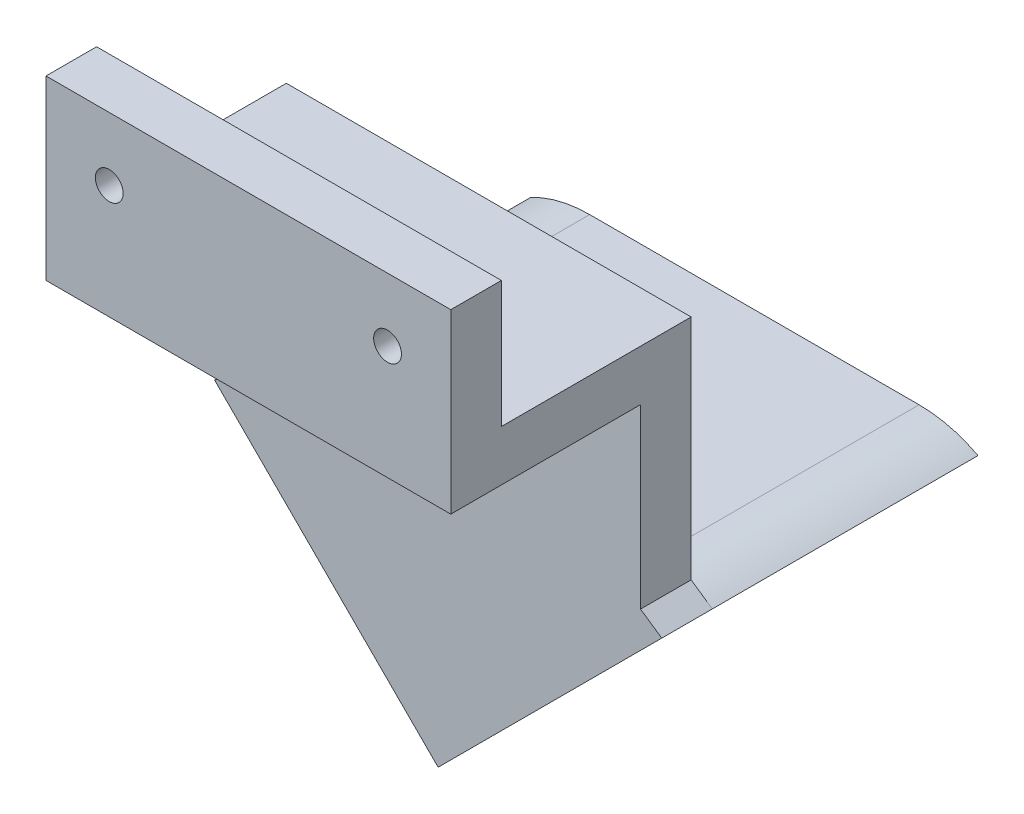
ISO-10303-21;
HEADER;
FILE_DESCRIPTION(('STEP AP214'),'2;1');
FILE_NAME('part.step','',(''),(''),'','','');
FILE_SCHEMA(('AUTOMOTIVE_DESIGN { 1 0 10303 214 1 1 1 1 }'));
ENDSEC;
DATA;
#1=APPLICATION_CONTEXT('core data for automotive mechanical design processes');
#2=APPLICATION_PROTOCOL_DEFINITION('international standard','automotive_design',2000,#1);
#3=PRODUCT_CONTEXT('',#1,'mechanical');
#4=PRODUCT('Part','Part','',(#3));
#5=PRODUCT_RELATED_PRODUCT_CATEGORY('part','',(#4));
#6=PRODUCT_DEFINITION_FORMATION('','',#4);
#7=PRODUCT_DEFINITION_CONTEXT('part definition',#1,'design');
#8=PRODUCT_DEFINITION('design','',#6,#7);
#9=PRODUCT_DEFINITION_SHAPE('','',#8);
#10=(LENGTH_UNIT() NAMED_UNIT(*) SI_UNIT(.MILLI.,.METRE.));
#11=(NAMED_UNIT(*) PLANE_ANGLE_UNIT() SI_UNIT($,.RADIAN.));
#12=(NAMED_UNIT(*) SI_UNIT($,.STERADIAN.) SOLID_ANGLE_UNIT());
#13=UNCERTAINTY_MEASURE_WITH_UNIT(LENGTH_MEASURE(1.E-05),#10,'distance_accuracy_value','');
#14=(GEOMETRIC_REPRESENTATION_CONTEXT(3) GLOBAL_UNCERTAINTY_ASSIGNED_CONTEXT((#13)) GLOBAL_UNIT_ASSIGNED_CONTEXT((#10,
#11,#12)) REPRESENTATION_CONTEXT('',''));
#15=CARTESIAN_POINT('',(0.,0.,0.));
#16=DIRECTION('',(0.,0.,1.));
#17=DIRECTION('',(1.,0.,0.));
#18=AXIS2_PLACEMENT_3D('',#15,#16,#17);
#19=CARTESIAN_POINT('',(0.,0.,-15.));
#20=DIRECTION('',(0.,0.,-1.));
#21=DIRECTION('',(-1.,0.,0.));
#22=AXIS2_PLACEMENT_3D('',#19,#20,#21);
#23=PLANE('',#22);
#24=DIRECTION('',(0.,-1.,0.));
#25=VECTOR('',#24,1.);
#26=CARTESIAN_POINT('',(11.5240963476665,-0.296650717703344,-15.));
#27=LINE('',#26,#25);
#28=CARTESIAN_POINT('',(11.5240963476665,3.70334928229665,-15.));
#29=VERTEX_POINT('',#28);
#30=CARTESIAN_POINT('',(11.5240963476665,-14.2966507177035,-15.));
#31=VERTEX_POINT('',#30);
#32=EDGE_CURVE('E155',#29,#31,#27,.T.);
#33=ORIENTED_EDGE('',*,*,#32,.T.);
#34=DIRECTION('',(-0.824647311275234,0.565647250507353,0.));
#35=VECTOR('',#34,1.);
#36=CARTESIAN_POINT('',(13.2017658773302,-15.4474083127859,-15.));
#37=LINE('',#36,#35);
#38=CARTESIAN_POINT('',(13.2017658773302,-15.4474083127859,-15.));
#39=VERTEX_POINT('',#38);
#40=EDGE_CURVE('E137',#39,#31,#37,.T.);
#41=ORIENTED_EDGE('',*,*,#40,.F.);
#42=CARTESIAN_POINT('',(8.54441589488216,-24.2966507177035,-15.));
#43=DIRECTION('',(0.,0.,-1.));
#44=DIRECTION('',(-1.,0.,0.));
#45=AXIS2_PLACEMENT_3D('',#42,#43,#44);
#46=CIRCLE('',#45,10.);
#47=CARTESIAN_POINT('',(8.54441589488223,-14.2966507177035,-15.));
#48=VERTEX_POINT('',#47);
#49=EDGE_CURVE('E48',#39,#48,#46,.F.);
#50=ORIENTED_EDGE('',*,*,#49,.T.);
#51=DIRECTION('',(1.,0.,0.));
#52=VECTOR('',#51,1.);
#53=CARTESIAN_POINT('',(-20.4759036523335,-14.2966507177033,-15.));
#54=LINE('',#53,#52);
#55=CARTESIAN_POINT('',(-17.4962231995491,-14.2966507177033,-15.));
#56=VERTEX_POINT('',#55);
#57=EDGE_CURVE('E253',#56,#48,#54,.T.);
#58=ORIENTED_EDGE('',*,*,#57,.F.);
#59=CARTESIAN_POINT('',(-17.4962231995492,-24.2966507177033,-15.));
#60=DIRECTION('',(0.,0.,-1.));
#61=DIRECTION('',(-1.,0.,0.));
#62=AXIS2_PLACEMENT_3D('',#59,#60,#61);
#63=CIRCLE('',#62,10.);
#64=CARTESIAN_POINT('',(-22.1535731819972,-15.4474083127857,-15.));
#65=VERTEX_POINT('',#64);
#66=EDGE_CURVE('E11',#56,#65,#63,.F.);
#67=ORIENTED_EDGE('',*,*,#66,.T.);
#68=DIRECTION('',(-0.824647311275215,-0.56564725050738,0.));
#69=VECTOR('',#68,1.);
#70=CARTESIAN_POINT('',(-22.1535731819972,-15.4474083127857,-15.));
#71=LINE('',#70,#69);
#72=CARTESIAN_POINT('',(-20.4759036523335,-14.2966507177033,-15.));
#73=VERTEX_POINT('',#72);
#74=EDGE_CURVE('E54',#73,#65,#71,.T.);
#75=ORIENTED_EDGE('',*,*,#74,.F.);
#76=DIRECTION('',(0.,1.,0.));
#77=VECTOR('',#76,1.);
#78=CARTESIAN_POINT('',(-20.4759036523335,-0.296650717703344,-15.));
#79=LINE('',#78,#77);
#80=CARTESIAN_POINT('',(-20.4759036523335,3.70334928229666,-15.));
#81=VERTEX_POINT('',#80);
#82=EDGE_CURVE('E172',#73,#81,#79,.T.);
#83=ORIENTED_EDGE('',*,*,#82,.T.);
#84=DIRECTION('',(1.,0.,0.));
#85=VECTOR('',#84,1.);
#86=CARTESIAN_POINT('',(-20.4759036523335,3.70334928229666,-15.));
#87=LINE('',#86,#85);
#88=EDGE_CURVE('E163',#81,#29,#87,.T.);
#89=ORIENTED_EDGE('',*,*,#88,.T.);
#90=EDGE_LOOP('',(#33,#41,#50,#58,#67,#75,#83,#89));
#91=FACE_BOUND('',#90,.T.);
#92=ADVANCED_FACE('F39',(#91),#23,.T.);
#93=CARTESIAN_POINT('',(-20.4759036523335,13.7033492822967,4.00000000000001));
#94=DIRECTION('',(1.,0.,0.));
#95=DIRECTION('',(0.,1.,0.));
#96=AXIS2_PLACEMENT_3D('',#93,#94,#95);
#97=PLANE('',#96);
#98=DIRECTION('',(0.,0.,1.));
#99=VECTOR('',#98,1.);
#100=CARTESIAN_POINT('',(-20.4759036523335,-14.2966507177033,-92.0351476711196));
#101=LINE('',#100,#99);
#102=CARTESIAN_POINT('',(-20.4759036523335,-14.2966507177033,-11.));
#103=VERTEX_POINT('',#102);
#104=EDGE_CURVE('E160',#73,#103,#101,.T.);
#105=ORIENTED_EDGE('',*,*,#104,.T.);
#106=DIRECTION('',(0.,1.,0.));
#107=VECTOR('',#106,1.);
#108=CARTESIAN_POINT('',(-20.4759036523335,-30.2966507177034,-11.));
#109=LINE('',#108,#107);
#110=CARTESIAN_POINT('',(-20.4759036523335,-0.296650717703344,-11.));
#111=VERTEX_POINT('',#110);
#112=EDGE_CURVE('E314',#103,#111,#109,.T.);
#113=ORIENTED_EDGE('',*,*,#112,.T.);
#114=DIRECTION('',(0.,0.,-1.));
#115=VECTOR('',#114,1.);
#116=CARTESIAN_POINT('',(-20.4759036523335,-0.296650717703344,4.00000000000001));
#117=LINE('',#116,#115);
#118=CARTESIAN_POINT('',(-20.4759036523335,-0.296650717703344,4.00000000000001));
#119=VERTEX_POINT('',#118);
#120=EDGE_CURVE('E231',#119,#111,#117,.T.);
#121=ORIENTED_EDGE('',*,*,#120,.F.);
#122=DIRECTION('',(0.,-1.,0.));
#123=VECTOR('',#122,1.);
#124=CARTESIAN_POINT('',(-20.4759036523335,13.7033492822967,4.00000000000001));
#125=LINE('',#124,#123);
#126=CARTESIAN_POINT('',(-20.4759036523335,13.7033492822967,4.00000000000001));
#127=VERTEX_POINT('',#126);
#128=EDGE_CURVE('E196',#127,#119,#125,.T.);
#129=ORIENTED_EDGE('',*,*,#128,.F.);
#130=DIRECTION('',(0.,0.,-1.));
#131=VECTOR('',#130,1.);
#132=CARTESIAN_POINT('',(-20.4759036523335,13.7033492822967,4.00000000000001));
#133=LINE('',#132,#131);
#134=CARTESIAN_POINT('',(-20.4759036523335,13.7033492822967,0.));
#135=VERTEX_POINT('',#134);
#136=EDGE_CURVE('E212',#127,#135,#133,.T.);
#137=ORIENTED_EDGE('',*,*,#136,.T.);
#138=DIRECTION('',(0.,-1.,0.));
#139=VECTOR('',#138,1.);
#140=CARTESIAN_POINT('',(-20.4759036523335,13.7033492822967,0.));
#141=LINE('',#140,#139);
#142=CARTESIAN_POINT('',(-20.4759036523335,3.70334928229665,0.));
#143=VERTEX_POINT('',#142);
#144=EDGE_CURVE('E213',#135,#143,#141,.T.);
#145=ORIENTED_EDGE('',*,*,#144,.T.);
#146=DIRECTION('',(0.,0.,1.));
#147=VECTOR('',#146,1.);
#148=CARTESIAN_POINT('',(-20.4759036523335,3.70334928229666,-15.));
#149=LINE('',#148,#147);
#150=EDGE_CURVE('E170',#81,#143,#149,.T.);
#151=ORIENTED_EDGE('',*,*,#150,.F.);
#152=ORIENTED_EDGE('',*,*,#82,.F.);
#153=EDGE_LOOP('',(#105,#113,#121,#129,#137,#145,#151,#152));
#154=FACE_BOUND('',#153,.T.);
#155=ADVANCED_FACE('F324',(#154),#97,.F.);
#156=CARTESIAN_POINT('',(11.5240963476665,13.7033492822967,4.00000000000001));
#157=DIRECTION('',(1.,0.,0.));
#158=DIRECTION('',(0.,0.,-1.));
#159=AXIS2_PLACEMENT_3D('',#156,#157,#158);
#160=PLANE('',#159);
#161=DIRECTION('',(0.,1.,0.));
#162=VECTOR('',#161,1.);
#163=CARTESIAN_POINT('',(11.5240963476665,-30.2966507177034,-11.));
#164=LINE('',#163,#162);
#165=CARTESIAN_POINT('',(11.5240963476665,-14.2966507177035,-11.));
#166=VERTEX_POINT('',#165);
#167=CARTESIAN_POINT('',(11.5240963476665,-0.296650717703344,-11.));
#168=VERTEX_POINT('',#167);
#169=EDGE_CURVE('E157',#166,#168,#164,.T.);
#170=ORIENTED_EDGE('',*,*,#169,.F.);
#171=DIRECTION('',(0.,0.,1.));
#172=VECTOR('',#171,1.);
#173=CARTESIAN_POINT('',(11.5240963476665,-14.2966507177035,-92.0351476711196));
#174=LINE('',#173,#172);
#175=EDGE_CURVE('E141',#31,#166,#174,.T.);
#176=ORIENTED_EDGE('',*,*,#175,.F.);
#177=ORIENTED_EDGE('',*,*,#32,.F.);
#178=DIRECTION('',(0.,0.,1.));
#179=VECTOR('',#178,1.);
#180=CARTESIAN_POINT('',(11.5240963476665,3.70334928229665,-15.));
#181=LINE('',#180,#179);
#182=CARTESIAN_POINT('',(11.5240963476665,3.70334928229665,0.));
#183=VERTEX_POINT('',#182);
#184=EDGE_CURVE('E166',#29,#183,#181,.T.);
#185=ORIENTED_EDGE('',*,*,#184,.T.);
#186=DIRECTION('',(0.,-1.,0.));
#187=VECTOR('',#186,1.);
#188=CARTESIAN_POINT('',(11.5240963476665,13.7033492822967,0.));
#189=LINE('',#188,#187);
#190=CARTESIAN_POINT('',(11.5240963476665,13.7033492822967,0.));
#191=VERTEX_POINT('',#190);
#192=EDGE_CURVE('E217',#191,#183,#189,.T.);
#193=ORIENTED_EDGE('',*,*,#192,.F.);
#194=DIRECTION('',(0.,0.,-1.));
#195=VECTOR('',#194,1.);
#196=CARTESIAN_POINT('',(11.5240963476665,13.7033492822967,4.00000000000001));
#197=LINE('',#196,#195);
#198=CARTESIAN_POINT('',(11.5240963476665,13.7033492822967,4.00000000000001));
#199=VERTEX_POINT('',#198);
#200=EDGE_CURVE('E225',#199,#191,#197,.T.);
#201=ORIENTED_EDGE('',*,*,#200,.F.);
#202=DIRECTION('',(0.,-1.,0.));
#203=VECTOR('',#202,1.);
#204=CARTESIAN_POINT('',(11.5240963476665,13.7033492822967,4.00000000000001));
#205=LINE('',#204,#203);
#206=CARTESIAN_POINT('',(11.5240963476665,-0.296650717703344,4.00000000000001));
#207=VERTEX_POINT('',#206);
#208=EDGE_CURVE('E204',#199,#207,#205,.T.);
#209=ORIENTED_EDGE('',*,*,#208,.T.);
#210=DIRECTION('',(0.,0.,-1.));
#211=VECTOR('',#210,1.);
#212=CARTESIAN_POINT('',(11.5240963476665,-0.296650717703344,4.00000000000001));
#213=LINE('',#212,#211);
#214=EDGE_CURVE('E228',#207,#168,#213,.T.);
#215=ORIENTED_EDGE('',*,*,#214,.T.);
#216=EDGE_LOOP('',(#170,#176,#177,#185,#193,#201,#209,#215));
#217=FACE_BOUND('',#216,.T.);
#218=ADVANCED_FACE('F153',(#217),#160,.T.);
#219=CARTESIAN_POINT('',(-20.4759036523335,-0.296650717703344,4.00000000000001));
#220=DIRECTION('',(0.,1.,0.));
#221=DIRECTION('',(0.,0.,1.));
#222=AXIS2_PLACEMENT_3D('',#219,#220,#221);
#223=PLANE('',#222);
#224=DIRECTION('',(-1.,0.,0.));
#225=VECTOR('',#224,1.);
#226=CARTESIAN_POINT('',(11.5240963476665,-0.296650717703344,-11.));
#227=LINE('',#226,#225);
#228=EDGE_CURVE('E159',#168,#111,#227,.T.);
#229=ORIENTED_EDGE('',*,*,#228,.F.);
#230=ORIENTED_EDGE('',*,*,#214,.F.);
#231=DIRECTION('',(1.,0.,0.));
#232=VECTOR('',#231,1.);
#233=CARTESIAN_POINT('',(-20.4759036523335,-0.296650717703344,4.00000000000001));
#234=LINE('',#233,#232);
#235=EDGE_CURVE('E200',#119,#207,#234,.T.);
#236=ORIENTED_EDGE('',*,*,#235,.F.);
#237=ORIENTED_EDGE('',*,*,#120,.T.);
#238=EDGE_LOOP('',(#229,#230,#236,#237));
#239=FACE_BOUND('',#238,.T.);
#240=ADVANCED_FACE('F341',(#239),#223,.F.);
#241=CARTESIAN_POINT('',(0.,0.,0.));
#242=DIRECTION('',(0.,0.,1.));
#243=DIRECTION('',(1.,0.,0.));
#244=AXIS2_PLACEMENT_3D('',#241,#242,#243);
#245=PLANE('',#244);
#246=CARTESIAN_POINT('',(6.52409634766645,8.70334928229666,0.));
#247=DIRECTION('',(0.,0.,1.));
#248=DIRECTION('',(1.,0.,0.));
#249=AXIS2_PLACEMENT_3D('',#246,#247,#248);
#250=CIRCLE('',#249,1.1);
#251=CARTESIAN_POINT('',(7.62409634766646,8.70334928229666,0.));
#252=VERTEX_POINT('',#251);
#253=EDGE_CURVE('E195',#252,#252,#250,.F.);
#254=ORIENTED_EDGE('',*,*,#253,.F.);
#255=EDGE_LOOP('',(#254));
#256=FACE_BOUND('',#255,.T.);
#257=CARTESIAN_POINT('',(-15.4759036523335,8.70334928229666,0.));
#258=DIRECTION('',(0.,0.,1.));
#259=DIRECTION('',(1.,0.,0.));
#260=AXIS2_PLACEMENT_3D('',#257,#258,#259);
#261=CIRCLE('',#260,1.1);
#262=CARTESIAN_POINT('',(-14.3759036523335,8.70334928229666,0.));
#263=VERTEX_POINT('',#262);
#264=EDGE_CURVE('E183',#263,#263,#261,.T.);
#265=ORIENTED_EDGE('',*,*,#264,.T.);
#266=EDGE_LOOP('',(#265));
#267=FACE_BOUND('',#266,.T.);
#268=DIRECTION('',(1.,0.,0.));
#269=VECTOR('',#268,1.);
#270=CARTESIAN_POINT('',(-20.4759036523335,3.70334928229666,0.));
#271=LINE('',#270,#269);
#272=EDGE_CURVE('E176',#143,#183,#271,.T.);
#273=ORIENTED_EDGE('',*,*,#272,.F.);
#274=ORIENTED_EDGE('',*,*,#144,.F.);
#275=DIRECTION('',(1.,0.,0.));
#276=VECTOR('',#275,1.);
#277=CARTESIAN_POINT('',(-20.4759036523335,13.7033492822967,0.));
#278=LINE('',#277,#276);
#279=EDGE_CURVE('E201',#135,#191,#278,.T.);
#280=ORIENTED_EDGE('',*,*,#279,.T.);
#281=ORIENTED_EDGE('',*,*,#192,.T.);
#282=EDGE_LOOP('',(#273,#274,#280,#281));
#283=FACE_BOUND('',#282,.T.);
#284=ADVANCED_FACE('F329',(#256,#267,#283),#245,.F.);
#285=CARTESIAN_POINT('',(-20.4759036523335,13.7033492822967,4.00000000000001));
#286=DIRECTION('',(0.,1.,0.));
#287=DIRECTION('',(0.,0.,1.));
#288=AXIS2_PLACEMENT_3D('',#285,#286,#287);
#289=PLANE('',#288);
#290=ORIENTED_EDGE('',*,*,#279,.F.);
#291=ORIENTED_EDGE('',*,*,#136,.F.);
#292=DIRECTION('',(1.,0.,0.));
#293=VECTOR('',#292,1.);
#294=CARTESIAN_POINT('',(-20.4759036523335,13.7033492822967,4.00000000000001));
#295=LINE('',#294,#293);
#296=EDGE_CURVE('E208',#127,#199,#295,.T.);
#297=ORIENTED_EDGE('',*,*,#296,.T.);
#298=ORIENTED_EDGE('',*,*,#200,.T.);
#299=EDGE_LOOP('',(#290,#291,#297,#298));
#300=FACE_BOUND('',#299,.T.);
#301=ADVANCED_FACE('F331',(#300),#289,.T.);
#302=CARTESIAN_POINT('',(0.,0.,4.00000000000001));
#303=DIRECTION('',(0.,0.,1.));
#304=DIRECTION('',(1.,0.,0.));
#305=AXIS2_PLACEMENT_3D('',#302,#303,#304);
#306=PLANE('',#305);
#307=CARTESIAN_POINT('',(-15.4759036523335,8.70334928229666,4.00000000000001));
#308=DIRECTION('',(0.,0.,1.));
#309=DIRECTION('',(1.,0.,0.));
#310=AXIS2_PLACEMENT_3D('',#307,#308,#309);
#311=CIRCLE('',#310,1.1);
#312=CARTESIAN_POINT('',(-14.3759036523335,8.70334928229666,4.00000000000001));
#313=VERTEX_POINT('',#312);
#314=EDGE_CURVE('E187',#313,#313,#311,.F.);
#315=ORIENTED_EDGE('',*,*,#314,.T.);
#316=EDGE_LOOP('',(#315));
#317=FACE_BOUND('',#316,.T.);
#318=CARTESIAN_POINT('',(6.52409634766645,8.70334928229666,4.00000000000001));
#319=DIRECTION('',(0.,0.,1.));
#320=DIRECTION('',(1.,0.,0.));
#321=AXIS2_PLACEMENT_3D('',#318,#319,#320);
#322=CIRCLE('',#321,1.1);
#323=CARTESIAN_POINT('',(7.62409634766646,8.70334928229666,4.00000000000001));
#324=VERTEX_POINT('',#323);
#325=EDGE_CURVE('E191',#324,#324,#322,.T.);
#326=ORIENTED_EDGE('',*,*,#325,.F.);
#327=EDGE_LOOP('',(#326));
#328=FACE_BOUND('',#327,.T.);
#329=ORIENTED_EDGE('',*,*,#128,.T.);
#330=ORIENTED_EDGE('',*,*,#235,.T.);
#331=ORIENTED_EDGE('',*,*,#208,.F.);
#332=ORIENTED_EDGE('',*,*,#296,.F.);
#333=EDGE_LOOP('',(#329,#330,#331,#332));
#334=FACE_BOUND('',#333,.T.);
#335=ADVANCED_FACE('F336',(#317,#328,#334),#306,.T.);
#336=CARTESIAN_POINT('',(6.52409634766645,8.70334928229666,4.00000000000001));
#337=DIRECTION('',(0.,0.,-1.));
#338=DIRECTION('',(-1.,0.,0.));
#339=AXIS2_PLACEMENT_3D('',#336,#337,#338);
#340=CYLINDRICAL_SURFACE('',#339,1.1);
#341=ORIENTED_EDGE('',*,*,#325,.T.);
#342=EDGE_LOOP('',(#341));
#343=FACE_BOUND('',#342,.T.);
#344=ORIENTED_EDGE('',*,*,#253,.T.);
#345=EDGE_LOOP('',(#344));
#346=FACE_BOUND('',#345,.T.);
#347=ADVANCED_FACE('F375',(#343,#346),#340,.F.);
#348=CARTESIAN_POINT('',(-15.4759036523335,8.70334928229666,5.00000000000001));
#349=DIRECTION('',(0.,0.,-1.));
#350=DIRECTION('',(-1.,0.,0.));
#351=AXIS2_PLACEMENT_3D('',#348,#349,#350);
#352=CYLINDRICAL_SURFACE('',#351,1.1);
#353=ORIENTED_EDGE('',*,*,#314,.F.);
#354=EDGE_LOOP('',(#353));
#355=FACE_BOUND('',#354,.T.);
#356=ORIENTED_EDGE('',*,*,#264,.F.);
#357=EDGE_LOOP('',(#356));
#358=FACE_BOUND('',#357,.T.);
#359=ADVANCED_FACE('F372',(#355,#358),#352,.F.);
#360=CARTESIAN_POINT('',(-20.4759036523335,3.70334928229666,-15.));
#361=DIRECTION('',(0.,-1.,0.));
#362=DIRECTION('',(1.,0.,0.));
#363=AXIS2_PLACEMENT_3D('',#360,#361,#362);
#364=PLANE('',#363);
#365=ORIENTED_EDGE('',*,*,#272,.T.);
#366=ORIENTED_EDGE('',*,*,#184,.F.);
#367=ORIENTED_EDGE('',*,*,#88,.F.);
#368=ORIENTED_EDGE('',*,*,#150,.T.);
#369=EDGE_LOOP('',(#365,#366,#367,#368));
#370=FACE_BOUND('',#369,.T.);
#371=ADVANCED_FACE('F323',(#370),#364,.F.);
#372=CARTESIAN_POINT('',(11.5240963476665,-30.2966507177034,-11.));
#373=DIRECTION('',(0.,0.,-1.));
#374=DIRECTION('',(-1.,0.,0.));
#375=AXIS2_PLACEMENT_3D('',#372,#373,#374);
#376=PLANE('',#375);
#377=DIRECTION('',(0.824647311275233,-0.565647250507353,0.));
#378=VECTOR('',#377,1.);
#379=CARTESIAN_POINT('',(13.2017658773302,-15.4474083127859,-11.));
#380=LINE('',#379,#378);
#381=CARTESIAN_POINT('',(13.2017658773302,-15.4474083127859,-11.));
#382=VERTEX_POINT('',#381);
#383=EDGE_CURVE('E283',#166,#382,#380,.T.);
#384=ORIENTED_EDGE('',*,*,#383,.F.);
#385=ORIENTED_EDGE('',*,*,#169,.T.);
#386=ORIENTED_EDGE('',*,*,#228,.T.);
#387=ORIENTED_EDGE('',*,*,#112,.F.);
#388=DIRECTION('',(0.824647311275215,0.56564725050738,0.));
#389=VECTOR('',#388,1.);
#390=CARTESIAN_POINT('',(-22.1535731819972,-15.4474083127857,-11.));
#391=LINE('',#390,#389);
#392=CARTESIAN_POINT('',(-22.1535731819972,-15.4474083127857,-11.));
#393=VERTEX_POINT('',#392);
#394=EDGE_CURVE('E296',#393,#103,#391,.T.);
#395=ORIENTED_EDGE('',*,*,#394,.F.);
#396=DIRECTION('',(-0.707106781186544,0.707106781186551,0.));
#397=VECTOR('',#396,1.);
#398=CARTESIAN_POINT('',(-4.4759036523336,-33.1250778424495,-11.));
#399=LINE('',#398,#397);
#400=CARTESIAN_POINT('',(-4.4759036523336,-33.1250778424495,-11.));
#401=VERTEX_POINT('',#400);
#402=EDGE_CURVE('E292',#401,#393,#399,.T.);
#403=ORIENTED_EDGE('',*,*,#402,.F.);
#404=DIRECTION('',(-0.707106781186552,-0.707106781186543,0.));
#405=VECTOR('',#404,1.);
#406=CARTESIAN_POINT('',(-4.4759036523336,-33.1250778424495,-11.));
#407=LINE('',#406,#405);
#408=EDGE_CURVE('E289',#382,#401,#407,.T.);
#409=ORIENTED_EDGE('',*,*,#408,.F.);
#410=EDGE_LOOP('',(#384,#385,#386,#387,#395,#403,#409));
#411=FACE_BOUND('',#410,.T.);
#412=ADVANCED_FACE('F344',(#411),#376,.F.);
#413=CARTESIAN_POINT('',(-22.1535731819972,-15.4474083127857,-11.));
#414=DIRECTION('',(-0.56564725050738,0.824647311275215,0.));
#415=DIRECTION('',(-0.824647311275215,-0.56564725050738,0.));
#416=AXIS2_PLACEMENT_3D('',#413,#414,#415);
#417=PLANE('',#416);
#418=ORIENTED_EDGE('',*,*,#104,.F.);
#419=ORIENTED_EDGE('',*,*,#74,.T.);
#420=DIRECTION('',(0.,0.,-1.));
#421=VECTOR('',#420,1.);
#422=CARTESIAN_POINT('',(-22.1535731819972,-15.4474083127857,-11.));
#423=LINE('',#422,#421);
#424=EDGE_CURVE('E299',#393,#65,#423,.T.);
#425=ORIENTED_EDGE('',*,*,#424,.F.);
#426=ORIENTED_EDGE('',*,*,#394,.T.);
#427=EDGE_LOOP('',(#418,#419,#425,#426));
#428=FACE_BOUND('',#427,.T.);
#429=ADVANCED_FACE('F426',(#428),#417,.T.);
#430=CARTESIAN_POINT('',(-4.4759036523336,-33.1250778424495,-11.));
#431=DIRECTION('',(-0.707106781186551,-0.707106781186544,0.));
#432=DIRECTION('',(0.707106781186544,-0.707106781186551,0.));
#433=AXIS2_PLACEMENT_3D('',#430,#431,#432);
#434=PLANE('',#433);
#435=ORIENTED_EDGE('',*,*,#424,.T.);
#436=CARTESIAN_POINT('',(-22.1535731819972,-15.4474083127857,-36.));
#437=VERTEX_POINT('',#436);
#438=EDGE_CURVE('E303',#65,#437,#423,.T.);
#439=ORIENTED_EDGE('',*,*,#438,.T.);
#440=DIRECTION('',(-0.707106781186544,0.707106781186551,0.));
#441=VECTOR('',#440,1.);
#442=CARTESIAN_POINT('',(-4.4759036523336,-33.1250778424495,-36.));
#443=LINE('',#442,#441);
#444=CARTESIAN_POINT('',(-4.4759036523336,-33.1250778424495,-36.));
#445=VERTEX_POINT('',#444);
#446=EDGE_CURVE('E279',#445,#437,#443,.T.);
#447=ORIENTED_EDGE('',*,*,#446,.F.);
#448=DIRECTION('',(0.,0.,-1.));
#449=VECTOR('',#448,1.);
#450=CARTESIAN_POINT('',(-4.4759036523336,-33.1250778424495,-11.));
#451=LINE('',#450,#449);
#452=EDGE_CURVE('E277',#401,#445,#451,.T.);
#453=ORIENTED_EDGE('',*,*,#452,.F.);
#454=ORIENTED_EDGE('',*,*,#402,.T.);
#455=EDGE_LOOP('',(#435,#439,#447,#453,#454));
#456=FACE_BOUND('',#455,.T.);
#457=ADVANCED_FACE('F349',(#456),#434,.T.);
#458=CARTESIAN_POINT('',(-4.4759036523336,-33.1250778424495,-11.));
#459=DIRECTION('',(0.707106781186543,-0.707106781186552,0.));
#460=DIRECTION('',(0.707106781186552,0.707106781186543,0.));
#461=AXIS2_PLACEMENT_3D('',#458,#459,#460);
#462=PLANE('',#461);
#463=ORIENTED_EDGE('',*,*,#452,.T.);
#464=DIRECTION('',(-0.707106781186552,-0.707106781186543,0.));
#465=VECTOR('',#464,1.);
#466=CARTESIAN_POINT('',(-4.4759036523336,-33.1250778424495,-36.));
#467=LINE('',#466,#465);
#468=CARTESIAN_POINT('',(13.2017658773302,-15.4474083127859,-36.));
#469=VERTEX_POINT('',#468);
#470=EDGE_CURVE('E272',#469,#445,#467,.T.);
#471=ORIENTED_EDGE('',*,*,#470,.F.);
#472=DIRECTION('',(0.,0.,-1.));
#473=VECTOR('',#472,1.);
#474=CARTESIAN_POINT('',(13.2017658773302,-15.4474083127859,-11.));
#475=LINE('',#474,#473);
#476=EDGE_CURVE('E266',#39,#469,#475,.T.);
#477=ORIENTED_EDGE('',*,*,#476,.F.);
#478=EDGE_CURVE('E143',#382,#39,#475,.T.);
#479=ORIENTED_EDGE('',*,*,#478,.F.);
#480=ORIENTED_EDGE('',*,*,#408,.T.);
#481=EDGE_LOOP('',(#463,#471,#477,#479,#480));
#482=FACE_BOUND('',#481,.T.);
#483=ADVANCED_FACE('F275',(#482),#462,.T.);
#484=CARTESIAN_POINT('',(13.2017658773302,-15.4474083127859,-11.));
#485=DIRECTION('',(0.565647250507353,0.824647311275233,0.));
#486=DIRECTION('',(-0.824647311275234,0.565647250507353,0.));
#487=AXIS2_PLACEMENT_3D('',#484,#485,#486);
#488=PLANE('',#487);
#489=ORIENTED_EDGE('',*,*,#478,.T.);
#490=ORIENTED_EDGE('',*,*,#40,.T.);
#491=ORIENTED_EDGE('',*,*,#175,.T.);
#492=ORIENTED_EDGE('',*,*,#383,.T.);
#493=EDGE_LOOP('',(#489,#490,#491,#492));
#494=FACE_BOUND('',#493,.T.);
#495=ADVANCED_FACE('F139',(#494),#488,.T.);
#496=CARTESIAN_POINT('',(0.,0.,-36.));
#497=DIRECTION('',(0.,0.,1.));
#498=DIRECTION('',(1.,0.,0.));
#499=AXIS2_PLACEMENT_3D('',#496,#497,#498);
#500=PLANE('',#499);
#501=DIRECTION('',(1.,0.,0.));
#502=VECTOR('',#501,1.);
#503=CARTESIAN_POINT('',(-20.4759036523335,-14.2966507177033,-36.));
#504=LINE('',#503,#502);
#505=CARTESIAN_POINT('',(-17.4962231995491,-14.2966507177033,-36.));
#506=VERTEX_POINT('',#505);
#507=CARTESIAN_POINT('',(8.54441589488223,-14.2966507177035,-36.));
#508=VERTEX_POINT('',#507);
#509=EDGE_CURVE('E263',#506,#508,#504,.T.);
#510=ORIENTED_EDGE('',*,*,#509,.T.);
#511=CARTESIAN_POINT('',(8.54441589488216,-24.2966507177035,-36.));
#512=DIRECTION('',(0.,0.,1.));
#513=DIRECTION('',(1.,0.,0.));
#514=AXIS2_PLACEMENT_3D('',#511,#512,#513);
#515=CIRCLE('',#514,10.);
#516=EDGE_CURVE('E148',#508,#469,#515,.F.);
#517=ORIENTED_EDGE('',*,*,#516,.T.);
#518=ORIENTED_EDGE('',*,*,#470,.T.);
#519=ORIENTED_EDGE('',*,*,#446,.T.);
#520=CARTESIAN_POINT('',(-17.4962231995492,-24.2966507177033,-36.));
#521=DIRECTION('',(0.,0.,1.));
#522=DIRECTION('',(1.,0.,0.));
#523=AXIS2_PLACEMENT_3D('',#520,#521,#522);
#524=CIRCLE('',#523,10.);
#525=EDGE_CURVE('E245',#437,#506,#524,.F.);
#526=ORIENTED_EDGE('',*,*,#525,.T.);
#527=EDGE_LOOP('',(#510,#517,#518,#519,#526));
#528=FACE_BOUND('',#527,.T.);
#529=ADVANCED_FACE('F270',(#528),#500,.F.);
#530=CARTESIAN_POINT('',(-20.4759036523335,-14.2966507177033,-36.));
#531=DIRECTION('',(0.,-1.,0.));
#532=DIRECTION('',(1.,0.,0.));
#533=AXIS2_PLACEMENT_3D('',#530,#531,#532);
#534=PLANE('',#533);
#535=ORIENTED_EDGE('',*,*,#57,.T.);
#536=DIRECTION('',(0.,0.,-1.));
#537=VECTOR('',#536,1.);
#538=CARTESIAN_POINT('',(8.54441589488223,-14.2966507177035,-36.));
#539=LINE('',#538,#537);
#540=EDGE_CURVE('E241',#48,#508,#539,.T.);
#541=ORIENTED_EDGE('',*,*,#540,.T.);
#542=ORIENTED_EDGE('',*,*,#509,.F.);
#543=DIRECTION('',(0.,0.,1.));
#544=VECTOR('',#543,1.);
#545=CARTESIAN_POINT('',(-17.4962231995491,-14.2966507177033,-36.));
#546=LINE('',#545,#544);
#547=EDGE_CURVE('E235',#506,#56,#546,.T.);
#548=ORIENTED_EDGE('',*,*,#547,.T.);
#549=EDGE_LOOP('',(#535,#541,#542,#548));
#550=FACE_BOUND('',#549,.T.);
#551=ADVANCED_FACE('F258',(#550),#534,.F.);
#552=CARTESIAN_POINT('',(8.54441589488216,-24.2966507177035,-11.));
#553=DIRECTION('',(0.,0.,-1.));
#554=DIRECTION('',(-1.,0.,0.));
#555=AXIS2_PLACEMENT_3D('',#552,#553,#554);
#556=CYLINDRICAL_SURFACE('',#555,10.);
#557=ORIENTED_EDGE('',*,*,#49,.F.);
#558=ORIENTED_EDGE('',*,*,#476,.T.);
#559=ORIENTED_EDGE('',*,*,#516,.F.);
#560=ORIENTED_EDGE('',*,*,#540,.F.);
#561=EDGE_LOOP('',(#557,#558,#559,#560));
#562=FACE_BOUND('',#561,.T.);
#563=ADVANCED_FACE('F265',(#562),#556,.T.);
#564=CARTESIAN_POINT('',(-17.4962231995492,-24.2966507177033,-11.));
#565=DIRECTION('',(0.,0.,1.));
#566=DIRECTION('',(1.,0.,0.));
#567=AXIS2_PLACEMENT_3D('',#564,#565,#566);
#568=CYLINDRICAL_SURFACE('',#567,10.);
#569=ORIENTED_EDGE('',*,*,#66,.F.);
#570=ORIENTED_EDGE('',*,*,#547,.F.);
#571=ORIENTED_EDGE('',*,*,#525,.F.);
#572=ORIENTED_EDGE('',*,*,#438,.F.);
#573=EDGE_LOOP('',(#569,#570,#571,#572));
#574=FACE_BOUND('',#573,.T.);
#575=ADVANCED_FACE('F41',(#574),#568,.T.);
#576=CLOSED_SHELL('',(#92,#155,#218,#240,#284,#301,#335,#347,#359,#371,#412,#429,#457,#483,#495,
#529,#551,#563,#575));
#577=MANIFOLD_SOLID_BREP('B2',#576);
#578=ADVANCED_BREP_SHAPE_REPRESENTATION('',(#18,#577),#14);
#579=SHAPE_DEFINITION_REPRESENTATION(#9,#578);
ENDSEC;
END-ISO-10303-21;
